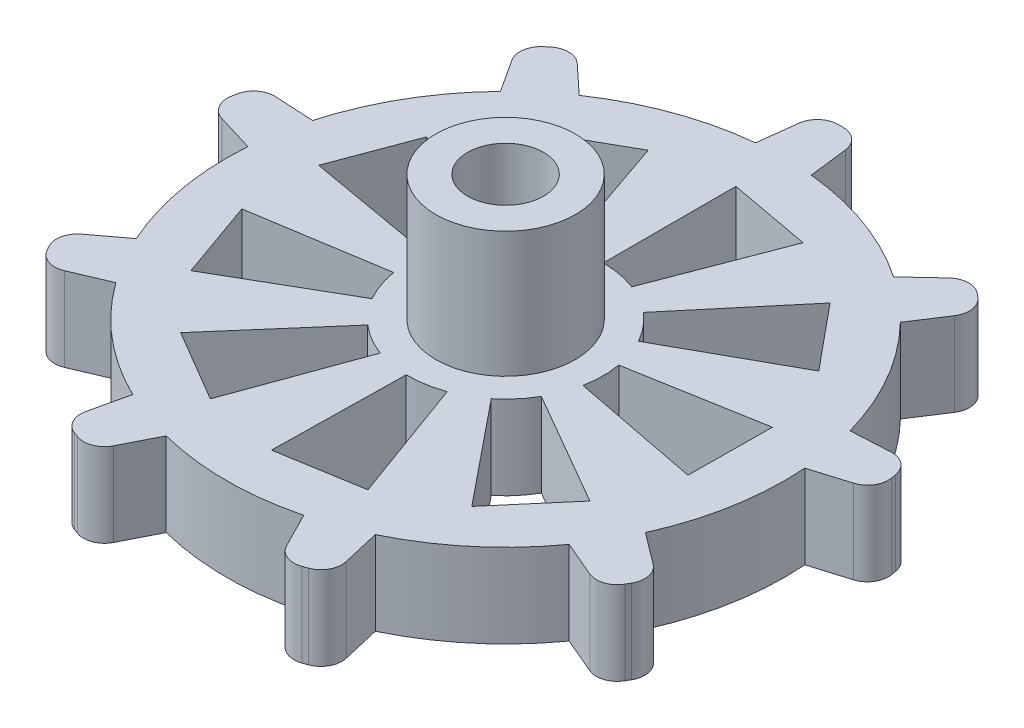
from build123d import *

# Parameters (mm, degrees)
ESBO_O1_R                = 2.75
RESSALTO_EXTRUS_O1_DEPTH = 6
ESBO_O2_R                = 5
ESBO_O2_R_2              = 2.722551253
RESSALTO_EXTRUS_O2_DEPTH = 9
FILETE1_R                = 1.5
FILETE2_R                = 1.5
FILETE3_R                = 1.5
FILETE4_R                = 1.5
FILETE5_R                = 1.5
FILETE6_R                = 1.5
FILETE7_R                = 1.5
FILETE8_R                = 1.5
FILETE9_R                = 1.5
FILETE10_R               = 1.5
FILETE11_R               = 1.5
FILETE12_R               = 1.5
FILETE13_R               = 1.5
FILETE14_R               = 1.5
FILETE15_R               = 1.5
FILETE16_R               = 1.5
FILETE17_R               = 1.5
FILETE18_R               = 1.5


with BuildPart() as part:
    # Esbo_o1 → Ressalto-extrus_o1 (new body)
    with BuildSketch(Plane(origin=(0, 0, 0), x_dir=(1, 0, 0), z_dir=(0, 1, 0))):
        with BuildLine():
            Line((-6.522081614, 25.594286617), (-8.022081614, 25.594286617))
            Line((-8.022081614, 25.594286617), (-8.5098566, 21.594286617))
            Line((-8.5098566, 21.594286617), (-8.522081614, 21.494035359))
            ThreePointArc((-8.522081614, 21.494035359), (-13.36248448, 20.388139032), (-17.781304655, 18.123953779))
            Line((-17.781304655, 18.123953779), (-20.799917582, 20.943534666))
            Line((-20.799917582, 20.943534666), (-23.098050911, 19.015171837))
            Line((-23.098050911, 19.015171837), (-20.845482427, 15.552803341))
            ThreePointArc((-20.845482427, 15.552803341), (-23.842589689, 11.594286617), (-25.772212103, 7.019457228))
            Line((-25.772212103, 7.019457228), (-29.89699542, 7.23905451))
            Line((-29.89699542, 7.23905451), (-30.417939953, 4.284631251))
            Line((-30.417939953, 4.284631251), (-26.466804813, 3.080226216))
            ThreePointArc((-26.466804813, 3.080226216), (-26.218236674, -1.878676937), (-24.755769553, -6.623536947))
            Line((-24.755769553, -6.623536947), (-28.056691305, -9.106675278))
            Line((-28.056691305, -9.106675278), (-26.556691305, -11.704751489))
            Line((-26.556691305, -11.704751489), (-22.755769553, -10.087638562))
            ThreePointArc((-22.755769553, -10.087638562), (-19.377833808, -13.726602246), (-15.207581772, -16.421320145))
            Line((-15.207581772, -16.421320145), (-16.140103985, -20.445306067))
            Line((-16.140103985, -20.445306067), (-13.321026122, -21.471366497))
            Line((-13.321026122, -21.471366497), (-11.448811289, -17.789400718))
            ThreePointArc((-11.448811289, -17.789400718), (-6.522081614, -18.405713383), (-1.595351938, -17.789400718))
            Line((-1.595351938, -17.789400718), (0.276862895, -21.471366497))
            Line((0.276862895, -21.471366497), (3.095940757, -20.445306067))
            Line((3.095940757, -20.445306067), (2.163418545, -16.421320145))
            ThreePointArc((2.163418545, -16.421320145), (6.33367058, -13.726602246), (9.711606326, -10.087638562))
            Line((9.711606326, -10.087638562), (13.512528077, -11.704751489))
            Line((13.512528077, -11.704751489), (15.012528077, -9.106675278))
            Line((15.012528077, -9.106675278), (11.711606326, -6.623536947))
            ThreePointArc((11.711606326, -6.623536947), (13.174073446, -1.878676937), (13.422641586, 3.080226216))
            Line((13.422641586, 3.080226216), (17.373776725, 4.284631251))
            Line((17.373776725, 4.284631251), (16.852832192, 7.23905451))
            Line((16.852832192, 7.23905451), (12.728048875, 7.019457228))
            ThreePointArc((12.728048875, 7.019457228), (10.798426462, 11.594286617), (7.8013192, 15.552803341))
            Line((7.8013192, 15.552803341), (10.053887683, 19.015171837))
            Line((10.053887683, 19.015171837), (7.755754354, 20.943534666))
            Line((7.755754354, 20.943534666), (4.737141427, 18.123953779))
            ThreePointArc((4.737141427, 18.123953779), (0.318321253, 20.388139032), (-4.522081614, 21.494035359))
            Line((-4.522081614, 21.494035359), (-4.534306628, 21.594286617))
            Line((-4.534306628, 21.594286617), (-5.022081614, 25.594286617))
            Line((-5.022081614, 25.594286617), (-6.522081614, 25.594286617))
        make_face()
        with BuildLine():
            ThreePointArc((-11.110008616, -3.692576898), (-10.072289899, -4.438624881), (-8.916222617, -4.983561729))
            Line((-8.916222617, -4.983561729), (-12.165413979, -13.910641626))
            Line((-12.165413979, -13.910641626), (-17.336480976, -10.867605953))
            Line((-17.336480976, -10.867605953), (-11.110008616, -3.692576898))
        make_face(mode=Mode.SUBTRACT)
        with BuildLine():
            ThreePointArc((-13.434967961, 0.493376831), (-13.119579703, -0.745161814), (-12.58425944, -1.905713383))
            Line((-12.58425944, -1.905713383), (-20.811500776, -6.655713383))
            Line((-20.811500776, -6.655713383), (-22.816742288, -1.000715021))
            Line((-22.816742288, -1.000715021), (-13.434967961, 0.493376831))
        make_face(mode=Mode.SUBTRACT)
        with Locations(Location((-6.522081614, 1.594286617, 0), (0, 0, 270))):
            Circle(ESBO_O1_R, mode=Mode.SUBTRACT)
        with BuildLine():
            ThreePointArc((-6.638307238, -5.404748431), (-5.363818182, -5.309221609), (-4.127940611, -4.983561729))
            Line((-4.127940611, -4.983561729), (-0.878749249, -13.910641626))
            Line((-0.878749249, -13.910641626), (-6.796042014, -14.903438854))
            Line((-6.796042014, -14.903438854), (-6.638307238, -5.404748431))
        make_face(mode=Mode.SUBTRACT)
        with BuildLine():
            ThreePointArc((-2.112222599, -3.84199368), (-1.197310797, -2.949590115), (-0.459903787, -1.905713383))
            Line((-0.459903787, -1.905713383), (7.767337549, -6.655713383))
            Line((7.767337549, -6.655713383), (3.872586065, -11.219802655))
            Line((3.872586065, -11.219802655), (-2.112222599, -3.84199368))
        make_face(mode=Mode.SUBTRACT)
        with BuildLine():
            ThreePointArc((0.350439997, 0.264457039), (0.477677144, 1.536171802), (0.371572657, 2.80982386))
            Line((0.371572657, 2.80982386), (9.727246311, 4.459481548))
            Line((9.727246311, 4.459481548), (9.677433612, -1.540311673))
            Line((9.677433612, -1.540311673), (0.350439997, 0.264457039))
        make_face(mode=Mode.SUBTRACT)
        with BuildLine():
            ThreePointArc((-12.525310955, 5.194458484), (-13.079826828, 4.042955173), (-13.415735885, 2.80982386))
            Line((-13.415735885, 2.80982386), (-22.771409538, 4.459481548))
            Line((-22.771409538, 4.459481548), (-20.672550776, 10.080406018))
            Line((-20.672550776, 10.080406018), (-12.525310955, 5.194458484))
        make_face(mode=Mode.SUBTRACT)
        with BuildLine():
            ThreePointArc((-8.806676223, 8.210979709), (-9.971632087, 7.685312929), (-11.021594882, 6.956597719))
            Line((-11.021594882, 6.956597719), (-17.128077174, 14.234019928))
            Line((-17.128077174, 14.234019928), (-11.907197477, 17.190777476))
            Line((-11.907197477, 17.190777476), (-8.806676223, 8.210979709))
        make_face(mode=Mode.SUBTRACT)
        with BuildLine():
            ThreePointArc((-4.019054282, 8.131476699), (-5.249354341, 8.477611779), (-6.522081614, 8.594286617))
            Line((-6.522081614, 8.594286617), (-6.522081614, 18.094286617))
            Line((-6.522081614, 18.094286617), (-0.622088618, 17.003377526))
            Line((-0.622088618, 17.003377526), (-4.019054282, 8.131476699))
        make_face(mode=Mode.SUBTRACT)
        with BuildLine():
            ThreePointArc((-0.402626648, 4.993149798), (-1.122599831, 6.049126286), (-2.022568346, 6.956597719))
            Line((-2.022568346, 6.956597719), (4.083913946, 14.234019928))
            Line((4.083913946, 14.234019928), (7.902347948, 9.605892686))
            Line((7.902347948, 9.605892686), (-0.402626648, 4.993149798))
        make_face(mode=Mode.SUBTRACT)
    extrude(amount=RESSALTO_EXTRUS_O1_DEPTH)

    # Esbo_o2 → Ressalto-extrus_o2 (add)
    with BuildSketch(Plane(origin=(0, 6, 0), x_dir=(1, 0, 0), z_dir=(0, 1, 0))):
        with Locations(Location((-6.522081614, 1.594286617, 0), (0, 0, 270))):
            Circle(ESBO_O2_R)
        with Locations(Location((-6.522081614, 1.594286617, 0), (0, 0, 270))):
            Circle(ESBO_O2_R_2, mode=Mode.SUBTRACT)
    extrude(amount=RESSALTO_EXTRUS_O2_DEPTH)

    # Filete1
    filete1_edges = [part.edges().sort_by_distance(p)[0] for p in [
        (-26.556691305, 3, 11.704751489),
    ]]
    fillet(filete1_edges, radius=FILETE1_R)

    # Filete2
    filete2_edges = [part.edges().sort_by_distance(p)[0] for p in [
        (-28.056691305, 3, 9.106675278),
    ]]
    fillet(filete2_edges, radius=FILETE2_R)

    # Filete3
    filete3_edges = [part.edges().sort_by_distance(p)[0] for p in [
        (-16.140103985, 3, 20.445306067),
    ]]
    fillet(filete3_edges, radius=FILETE3_R)

    # Filete4
    filete4_edges = [part.edges().sort_by_distance(p)[0] for p in [
        (-13.321026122, 3, 21.471366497),
    ]]
    fillet(filete4_edges, radius=FILETE4_R)

    # Filete5
    filete5_edges = [part.edges().sort_by_distance(p)[0] for p in [
        (0.276862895, 3, 21.471366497),
    ]]
    fillet(filete5_edges, radius=FILETE5_R)

    # Filete6
    filete6_edges = [part.edges().sort_by_distance(p)[0] for p in [
        (3.095940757, 3, 20.445306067),
    ]]
    fillet(filete6_edges, radius=FILETE6_R)

    # Filete7
    filete7_edges = [part.edges().sort_by_distance(p)[0] for p in [
        (13.512528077, 3, 11.704751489),
    ]]
    fillet(filete7_edges, radius=FILETE7_R)

    # Filete8
    filete8_edges = [part.edges().sort_by_distance(p)[0] for p in [
        (15.012528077, 3, 9.106675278),
    ]]
    fillet(filete8_edges, radius=FILETE8_R)

    # Filete9
    filete9_edges = [part.edges().sort_by_distance(p)[0] for p in [
        (17.373776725, 3, -4.284631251),
    ]]
    fillet(filete9_edges, radius=FILETE9_R)

    # Filete10
    filete10_edges = [part.edges().sort_by_distance(p)[0] for p in [
        (16.852832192, 3, -7.23905451),
    ]]
    fillet(filete10_edges, radius=FILETE10_R)

    # Filete11
    filete11_edges = [part.edges().sort_by_distance(p)[0] for p in [
        (-30.417939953, 3, -4.284631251),
    ]]
    fillet(filete11_edges, radius=FILETE11_R)

    # Filete12
    filete12_edges = [part.edges().sort_by_distance(p)[0] for p in [
        (10.053887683, 3, -19.015171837),
    ]]
    fillet(filete12_edges, radius=FILETE12_R)

    # Filete13
    filete13_edges = [part.edges().sort_by_distance(p)[0] for p in [
        (7.755754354, 3, -20.943534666),
    ]]
    fillet(filete13_edges, radius=FILETE13_R)

    # Filete14
    filete14_edges = [part.edges().sort_by_distance(p)[0] for p in [
        (-5.022081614, 3, -25.594286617),
    ]]
    fillet(filete14_edges, radius=FILETE14_R)

    # Filete15
    filete15_edges = [part.edges().sort_by_distance(p)[0] for p in [
        (-8.022081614, 3, -25.594286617),
    ]]
    fillet(filete15_edges, radius=FILETE15_R)

    # Filete16
    filete16_edges = [part.edges().sort_by_distance(p)[0] for p in [
        (-20.799917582, 3, -20.943534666),
    ]]
    fillet(filete16_edges, radius=FILETE16_R)

    # Filete17
    filete17_edges = [part.edges().sort_by_distance(p)[0] for p in [
        (-23.098050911, 3, -19.015171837),
    ]]
    fillet(filete17_edges, radius=FILETE17_R)

    # Filete18
    filete18_edges = [part.edges().sort_by_distance(p)[0] for p in [
        (-29.89699542, 3, -7.23905451),
    ]]
    fillet(filete18_edges, radius=FILETE18_R)


solid = part.part
